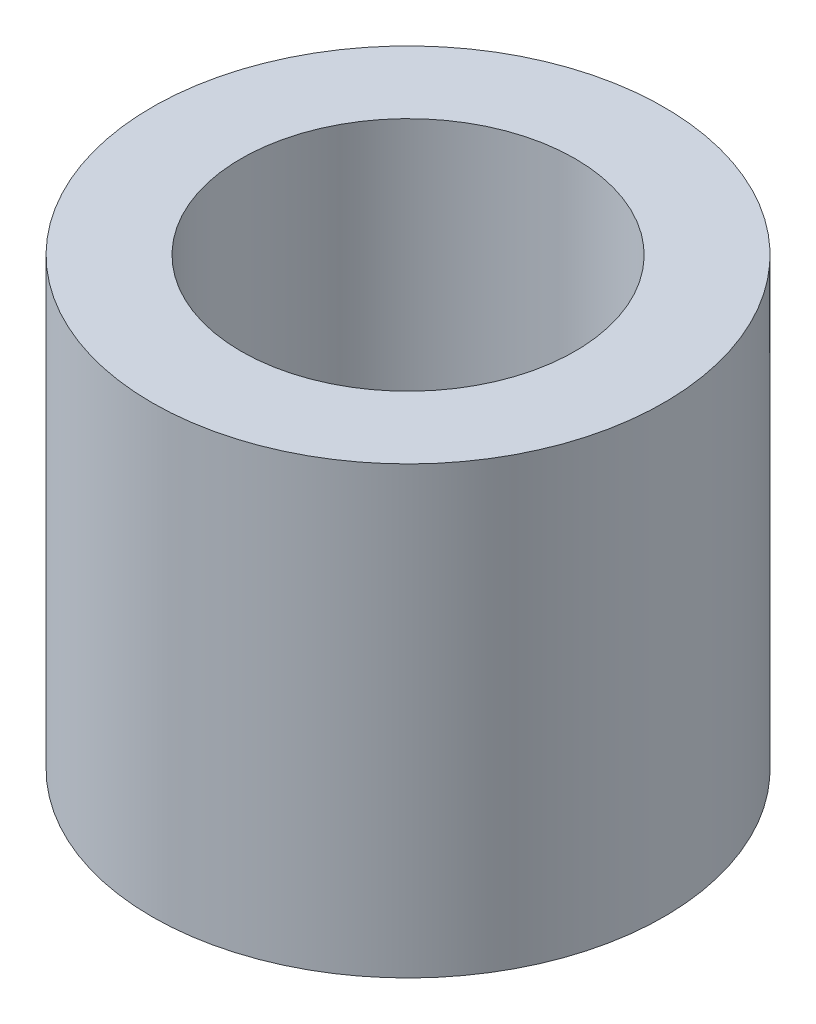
from build123d import *

# Parameters (mm, degrees)
SKETCH1_R           = 2.3
SKETCH1_R_2         = 1.5
BOSS_EXTRUDE1_DEPTH = 4


with BuildPart() as part:
    # Sketch1 → Boss-Extrude1 (new body)
    with BuildSketch(Plane(origin=(0, 0, 0), x_dir=(1, 0, 0), z_dir=(0, 1, 0))):
        with Locations(Location((0, 0, 0), (0, 0, 270))):
            Circle(SKETCH1_R)
        with Locations(Location((0, 0, 0), (0, 0, 270))):
            Circle(SKETCH1_R_2, mode=Mode.SUBTRACT)
    extrude(amount=BOSS_EXTRUDE1_DEPTH)


solid = part.part
